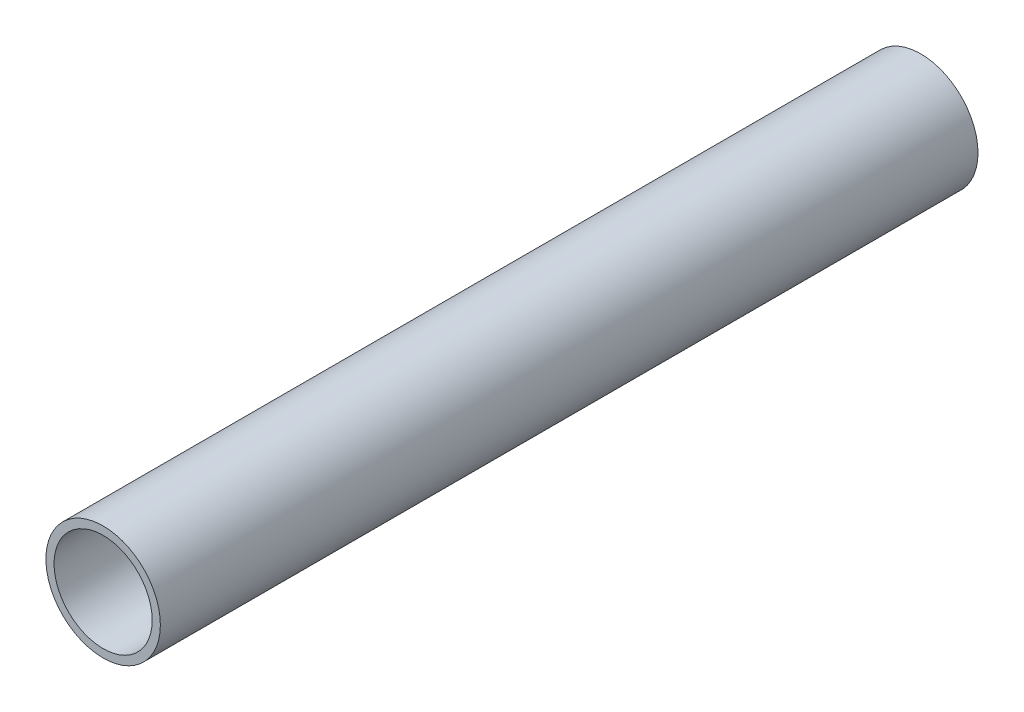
ISO-10303-21;
HEADER;
FILE_DESCRIPTION(('STEP AP214'),'2;1');
FILE_NAME('part.step','',(''),(''),'','','');
FILE_SCHEMA(('AUTOMOTIVE_DESIGN { 1 0 10303 214 1 1 1 1 }'));
ENDSEC;
DATA;
#1=APPLICATION_CONTEXT('core data for automotive mechanical design processes');
#2=APPLICATION_PROTOCOL_DEFINITION('international standard','automotive_design',2000,#1);
#3=PRODUCT_CONTEXT('',#1,'mechanical');
#4=PRODUCT('Part','Part','',(#3));
#5=PRODUCT_RELATED_PRODUCT_CATEGORY('part','',(#4));
#6=PRODUCT_DEFINITION_FORMATION('','',#4);
#7=PRODUCT_DEFINITION_CONTEXT('part definition',#1,'design');
#8=PRODUCT_DEFINITION('design','',#6,#7);
#9=PRODUCT_DEFINITION_SHAPE('','',#8);
#10=(LENGTH_UNIT() NAMED_UNIT(*) SI_UNIT(.MILLI.,.METRE.));
#11=(NAMED_UNIT(*) PLANE_ANGLE_UNIT() SI_UNIT($,.RADIAN.));
#12=(NAMED_UNIT(*) SI_UNIT($,.STERADIAN.) SOLID_ANGLE_UNIT());
#13=UNCERTAINTY_MEASURE_WITH_UNIT(LENGTH_MEASURE(1.E-05),#10,'distance_accuracy_value','');
#14=(GEOMETRIC_REPRESENTATION_CONTEXT(3) GLOBAL_UNCERTAINTY_ASSIGNED_CONTEXT((#13)) GLOBAL_UNIT_ASSIGNED_CONTEXT((#10,
#11,#12)) REPRESENTATION_CONTEXT('',''));
#15=CARTESIAN_POINT('',(0.,0.,0.));
#16=DIRECTION('',(0.,0.,1.));
#17=DIRECTION('',(1.,0.,0.));
#18=AXIS2_PLACEMENT_3D('',#15,#16,#17);
#19=CARTESIAN_POINT('',(0.,0.,300.));
#20=DIRECTION('',(0.,0.,-1.));
#21=DIRECTION('',(-1.,0.,0.));
#22=AXIS2_PLACEMENT_3D('',#19,#20,#21);
#23=CYLINDRICAL_SURFACE('',#22,21.);
#24=CARTESIAN_POINT('',(0.,0.,300.));
#25=DIRECTION('',(0.,0.,1.));
#26=DIRECTION('',(1.,0.,0.));
#27=AXIS2_PLACEMENT_3D('',#24,#25,#26);
#28=CIRCLE('',#27,21.);
#29=CARTESIAN_POINT('',(21.,0.,300.));
#30=VERTEX_POINT('',#29);
#31=EDGE_CURVE('E11',#30,#30,#28,.T.);
#32=ORIENTED_EDGE('',*,*,#31,.F.);
#33=EDGE_LOOP('',(#32));
#34=FACE_BOUND('',#33,.T.);
#35=CARTESIAN_POINT('',(0.,0.,0.));
#36=DIRECTION('',(0.,0.,1.));
#37=DIRECTION('',(1.,0.,0.));
#38=AXIS2_PLACEMENT_3D('',#35,#36,#37);
#39=CIRCLE('',#38,21.);
#40=CARTESIAN_POINT('',(21.,0.,0.));
#41=VERTEX_POINT('',#40);
#42=EDGE_CURVE('E61',#41,#41,#39,.T.);
#43=ORIENTED_EDGE('',*,*,#42,.T.);
#44=EDGE_LOOP('',(#43));
#45=FACE_BOUND('',#44,.T.);
#46=ADVANCED_FACE('F58',(#34,#45),#23,.T.);
#47=CARTESIAN_POINT('',(0.,0.,300.));
#48=DIRECTION('',(0.,0.,1.));
#49=DIRECTION('',(1.,0.,0.));
#50=AXIS2_PLACEMENT_3D('',#47,#48,#49);
#51=PLANE('',#50);
#52=CARTESIAN_POINT('',(0.,0.,300.));
#53=DIRECTION('',(0.,0.,1.));
#54=DIRECTION('',(1.,0.,0.));
#55=AXIS2_PLACEMENT_3D('',#52,#53,#54);
#56=CIRCLE('',#55,18.);
#57=CARTESIAN_POINT('',(18.,0.,300.));
#58=VERTEX_POINT('',#57);
#59=EDGE_CURVE('E75',#58,#58,#56,.T.);
#60=ORIENTED_EDGE('',*,*,#59,.F.);
#61=EDGE_LOOP('',(#60));
#62=FACE_BOUND('',#61,.T.);
#63=ORIENTED_EDGE('',*,*,#31,.T.);
#64=EDGE_LOOP('',(#63));
#65=FACE_BOUND('',#64,.T.);
#66=ADVANCED_FACE('F83',(#62,#65),#51,.T.);
#67=CARTESIAN_POINT('',(0.,0.,0.));
#68=DIRECTION('',(0.,0.,1.));
#69=DIRECTION('',(1.,0.,0.));
#70=AXIS2_PLACEMENT_3D('',#67,#68,#69);
#71=PLANE('',#70);
#72=CARTESIAN_POINT('',(0.,0.,0.));
#73=DIRECTION('',(0.,0.,1.));
#74=DIRECTION('',(1.,0.,0.));
#75=AXIS2_PLACEMENT_3D('',#72,#73,#74);
#76=CIRCLE('',#75,18.);
#77=CARTESIAN_POINT('',(18.,0.,0.));
#78=VERTEX_POINT('',#77);
#79=EDGE_CURVE('E70',#78,#78,#76,.T.);
#80=ORIENTED_EDGE('',*,*,#79,.T.);
#81=EDGE_LOOP('',(#80));
#82=FACE_BOUND('',#81,.T.);
#83=ORIENTED_EDGE('',*,*,#42,.F.);
#84=EDGE_LOOP('',(#83));
#85=FACE_BOUND('',#84,.T.);
#86=ADVANCED_FACE('F85',(#82,#85),#71,.F.);
#87=CARTESIAN_POINT('',(0.,0.,300.));
#88=DIRECTION('',(0.,0.,-1.));
#89=DIRECTION('',(-1.,0.,0.));
#90=AXIS2_PLACEMENT_3D('',#87,#88,#89);
#91=CYLINDRICAL_SURFACE('',#90,18.);
#92=ORIENTED_EDGE('',*,*,#59,.T.);
#93=EDGE_LOOP('',(#92));
#94=FACE_BOUND('',#93,.T.);
#95=ORIENTED_EDGE('',*,*,#79,.F.);
#96=EDGE_LOOP('',(#95));
#97=FACE_BOUND('',#96,.T.);
#98=ADVANCED_FACE('F80',(#94,#97),#91,.F.);
#99=CLOSED_SHELL('',(#46,#66,#86,#98));
#100=MANIFOLD_SOLID_BREP('B2',#99);
#101=ADVANCED_BREP_SHAPE_REPRESENTATION('',(#18,#100),#14);
#102=SHAPE_DEFINITION_REPRESENTATION(#9,#101);
ENDSEC;
END-ISO-10303-21;
